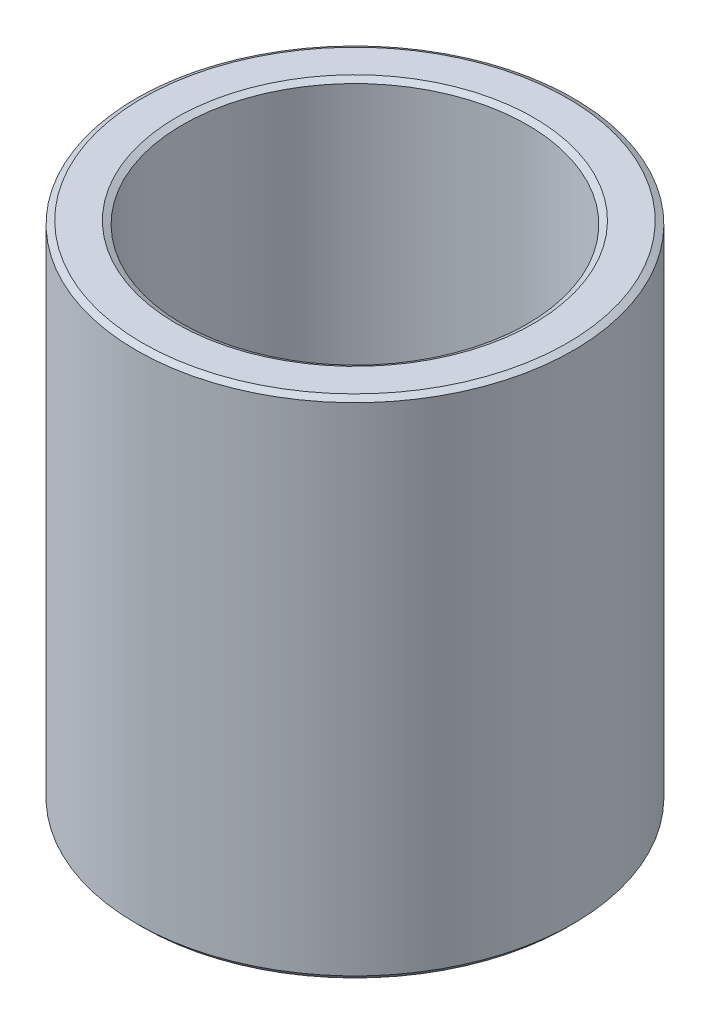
from build123d import *


with BuildPart() as part:
    # Sketch1 → Revolve1 (revolve)
    with BuildSketch(Plane(origin=(0, 0, 0), x_dir=(-1, 0, 0), z_dir=(0, 0, -1)), mode=Mode.PRIVATE) as revolve1_sk:
        Polygon((-8.266666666, 0), (-8, 0.266666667), (-8, 21.856666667), (-8.266666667, 22), (-9.733333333, 22), (-10, 21.856666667), (-10, 0.266666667), (-9.733333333, 0), align=None)
    revolve(revolve1_sk.sketch.rotate(Axis((0.5, 0, 0), (0, 1, 0)), 270), axis=Axis((0.5, 0, 0), (0, 1, 0)))


solid = part.part
